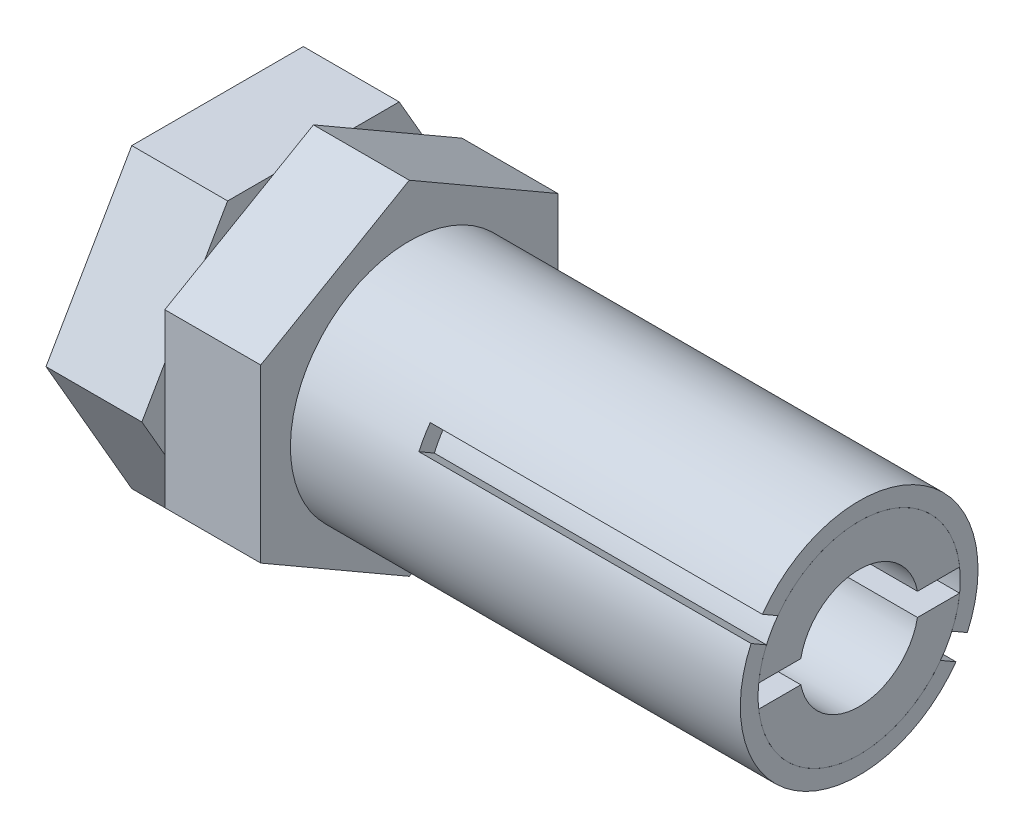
ISO-10303-21;
HEADER;
FILE_DESCRIPTION(('STEP AP214'),'2;1');
FILE_NAME('part.step','',(''),(''),'','','');
FILE_SCHEMA(('AUTOMOTIVE_DESIGN { 1 0 10303 214 1 1 1 1 }'));
ENDSEC;
DATA;
#1=APPLICATION_CONTEXT('core data for automotive mechanical design processes');
#2=APPLICATION_PROTOCOL_DEFINITION('international standard','automotive_design',2000,#1);
#3=PRODUCT_CONTEXT('',#1,'mechanical');
#4=PRODUCT('Part','Part','',(#3));
#5=PRODUCT_RELATED_PRODUCT_CATEGORY('part','',(#4));
#6=PRODUCT_DEFINITION_FORMATION('','',#4);
#7=PRODUCT_DEFINITION_CONTEXT('part definition',#1,'design');
#8=PRODUCT_DEFINITION('design','',#6,#7);
#9=PRODUCT_DEFINITION_SHAPE('','',#8);
#10=(LENGTH_UNIT() NAMED_UNIT(*) SI_UNIT(.MILLI.,.METRE.));
#11=(NAMED_UNIT(*) PLANE_ANGLE_UNIT() SI_UNIT($,.RADIAN.));
#12=(NAMED_UNIT(*) SI_UNIT($,.STERADIAN.) SOLID_ANGLE_UNIT());
#13=UNCERTAINTY_MEASURE_WITH_UNIT(LENGTH_MEASURE(1.E-05),#10,'distance_accuracy_value','');
#14=(GEOMETRIC_REPRESENTATION_CONTEXT(3) GLOBAL_UNCERTAINTY_ASSIGNED_CONTEXT((#13)) GLOBAL_UNIT_ASSIGNED_CONTEXT((#10,
#11,#12)) REPRESENTATION_CONTEXT('',''));
#15=CARTESIAN_POINT('',(0.,0.,0.));
#16=DIRECTION('',(0.,0.,1.));
#17=DIRECTION('',(1.,0.,0.));
#18=AXIS2_PLACEMENT_3D('',#15,#16,#17);
#19=CARTESIAN_POINT('',(21.59,0.,0.));
#20=DIRECTION('',(1.,0.,0.));
#21=DIRECTION('',(0.,0.,-1.));
#22=AXIS2_PLACEMENT_3D('',#19,#20,#21);
#23=PLANE('',#22);
#24=DIRECTION('',(0.,-0.499999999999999,-0.866025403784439));
#25=VECTOR('',#24,1.);
#26=CARTESIAN_POINT('',(21.59,4.27300486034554,6.63906151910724));
#27=LINE('',#26,#25);
#28=CARTESIAN_POINT('',(21.59,-1.3611483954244,-3.11957817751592));
#29=VERTEX_POINT('',#28);
#30=CARTESIAN_POINT('',(21.59,-1.66056432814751,-3.63818178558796));
#31=VERTEX_POINT('',#30);
#32=EDGE_CURVE('E273',#29,#31,#27,.T.);
#33=ORIENTED_EDGE('',*,*,#32,.T.);
#34=CARTESIAN_POINT('',(21.59,0.,0.));
#35=DIRECTION('',(1.,0.,0.));
#36=DIRECTION('',(0.,0.,-1.));
#37=AXIS2_PLACEMENT_3D('',#34,#35,#36);
#38=CIRCLE('',#37,3.99923);
#39=CARTESIAN_POINT('',(21.59,2.32047568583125,3.25718178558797));
#40=VERTEX_POINT('',#39);
#41=EDGE_CURVE('E51',#31,#40,#38,.T.);
#42=ORIENTED_EDGE('',*,*,#41,.T.);
#43=DIRECTION('',(0.,-0.499999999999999,-0.866025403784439));
#44=VECTOR('',#43,1.);
#45=CARTESIAN_POINT('',(21.59,-3.61309350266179,-7.02006151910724));
#46=LINE('',#45,#44);
#47=CARTESIAN_POINT('',(21.59,2.02105975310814,2.73857817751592));
#48=VERTEX_POINT('',#47);
#49=EDGE_CURVE('E153',#40,#48,#46,.T.);
#50=ORIENTED_EDGE('',*,*,#49,.T.);
#51=CARTESIAN_POINT('',(21.59,0.,0.));
#52=DIRECTION('',(1.,0.,0.));
#53=DIRECTION('',(0.,0.,-1.));
#54=AXIS2_PLACEMENT_3D('',#51,#52,#53);
#55=CIRCLE('',#54,3.4036);
#56=EDGE_CURVE('E128',#29,#48,#55,.T.);
#57=ORIENTED_EDGE('',*,*,#56,.F.);
#58=EDGE_LOOP('',(#33,#42,#50,#57));
#59=FACE_BOUND('',#58,.T.);
#60=ADVANCED_FACE('F42',(#59),#23,.T.);
#61=DIRECTION('',(0.,0.499999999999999,0.866025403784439));
#62=VECTOR('',#61,1.);
#63=CARTESIAN_POINT('',(21.59,3.6130935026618,7.02006151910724));
#64=LINE('',#63,#62);
#65=CARTESIAN_POINT('',(21.59,-2.32047568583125,-3.25718178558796));
#66=VERTEX_POINT('',#65);
#67=CARTESIAN_POINT('',(21.59,-2.02105975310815,-2.73857817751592));
#68=VERTEX_POINT('',#67);
#69=EDGE_CURVE('E109',#66,#68,#64,.T.);
#70=ORIENTED_EDGE('',*,*,#69,.T.);
#71=CARTESIAN_POINT('',(21.59,1.3611483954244,3.11957817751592));
#72=VERTEX_POINT('',#71);
#73=EDGE_CURVE('E119',#72,#68,#55,.T.);
#74=ORIENTED_EDGE('',*,*,#73,.F.);
#75=DIRECTION('',(0.,0.499999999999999,0.866025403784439));
#76=VECTOR('',#75,1.);
#77=CARTESIAN_POINT('',(21.59,-4.27300486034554,-6.63906151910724));
#78=LINE('',#77,#76);
#79=CARTESIAN_POINT('',(21.59,1.66056432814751,3.63818178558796));
#80=VERTEX_POINT('',#79);
#81=EDGE_CURVE('E66',#72,#80,#78,.T.);
#82=ORIENTED_EDGE('',*,*,#81,.T.);
#83=EDGE_CURVE('E12',#80,#66,#38,.T.);
#84=ORIENTED_EDGE('',*,*,#83,.T.);
#85=EDGE_LOOP('',(#70,#74,#82,#84));
#86=FACE_BOUND('',#85,.T.);
#87=ADVANCED_FACE('F118',(#86),#23,.T.);
#88=CARTESIAN_POINT('',(6.4516,0.,0.));
#89=DIRECTION('',(1.,0.,0.));
#90=DIRECTION('',(0.,0.,-1.));
#91=AXIS2_PLACEMENT_3D('',#88,#89,#90);
#92=PLANE('',#91);
#93=CARTESIAN_POINT('',(6.4516,0.,0.));
#94=DIRECTION('',(1.,0.,0.));
#95=DIRECTION('',(0.,0.,-1.));
#96=AXIS2_PLACEMENT_3D('',#93,#94,#95);
#97=CIRCLE('',#96,3.99923);
#98=CARTESIAN_POINT('',(6.4516,0.,-3.99923));
#99=VERTEX_POINT('',#98);
#100=EDGE_CURVE('E46',#99,#99,#97,.T.);
#101=ORIENTED_EDGE('',*,*,#100,.F.);
#102=EDGE_LOOP('',(#101));
#103=FACE_BOUND('',#102,.T.);
#104=CARTESIAN_POINT('',(6.4516,0.,0.));
#105=DIRECTION('',(1.,0.,0.));
#106=DIRECTION('',(0.,0.,-1.));
#107=AXIS2_PLACEMENT_3D('',#104,#105,#106);
#108=CIRCLE('',#107,3.4036);
#109=CARTESIAN_POINT('',(6.4516,0.,-3.4036));
#110=VERTEX_POINT('',#109);
#111=EDGE_CURVE('E131',#110,#110,#108,.T.);
#112=ORIENTED_EDGE('',*,*,#111,.T.);
#113=EDGE_LOOP('',(#112));
#114=FACE_BOUND('',#113,.T.);
#115=ADVANCED_FACE('F195',(#103,#114),#92,.F.);
#116=CARTESIAN_POINT('',(21.59,0.,0.));
#117=DIRECTION('',(-1.,0.,0.));
#118=DIRECTION('',(0.,0.,1.));
#119=AXIS2_PLACEMENT_3D('',#116,#117,#118);
#120=CYLINDRICAL_SURFACE('',#119,3.99923);
#121=ORIENTED_EDGE('',*,*,#41,.F.);
#122=DIRECTION('',(-1.,0.,0.));
#123=VECTOR('',#122,1.);
#124=CARTESIAN_POINT('',(21.59,-1.66056432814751,-3.63818178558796));
#125=LINE('',#124,#123);
#126=CARTESIAN_POINT('',(10.414,-1.66056432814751,-3.63818178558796));
#127=VERTEX_POINT('',#126);
#128=EDGE_CURVE('E269',#127,#31,#125,.F.);
#129=ORIENTED_EDGE('',*,*,#128,.F.);
#130=CARTESIAN_POINT('',(10.414,0.,0.));
#131=DIRECTION('',(-1.,0.,0.));
#132=DIRECTION('',(0.,0.,1.));
#133=AXIS2_PLACEMENT_3D('',#130,#131,#132);
#134=CIRCLE('',#133,3.99923);
#135=CARTESIAN_POINT('',(10.414,-2.32047568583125,-3.25718178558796));
#136=VERTEX_POINT('',#135);
#137=EDGE_CURVE('E267',#136,#127,#134,.F.);
#138=ORIENTED_EDGE('',*,*,#137,.F.);
#139=DIRECTION('',(-1.,0.,0.));
#140=VECTOR('',#139,1.);
#141=CARTESIAN_POINT('',(21.59,-2.32047568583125,-3.25718178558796));
#142=LINE('',#141,#140);
#143=EDGE_CURVE('E121',#66,#136,#142,.T.);
#144=ORIENTED_EDGE('',*,*,#143,.F.);
#145=ORIENTED_EDGE('',*,*,#83,.F.);
#146=DIRECTION('',(-1.,0.,0.));
#147=VECTOR('',#146,1.);
#148=CARTESIAN_POINT('',(21.59,1.6605643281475,3.63818178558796));
#149=LINE('',#148,#147);
#150=CARTESIAN_POINT('',(10.414,1.6605643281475,3.63818178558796));
#151=VERTEX_POINT('',#150);
#152=EDGE_CURVE('E137',#151,#80,#149,.F.);
#153=ORIENTED_EDGE('',*,*,#152,.F.);
#154=CARTESIAN_POINT('',(10.414,0.,0.));
#155=DIRECTION('',(-1.,0.,0.));
#156=DIRECTION('',(0.,0.,1.));
#157=AXIS2_PLACEMENT_3D('',#154,#155,#156);
#158=CIRCLE('',#157,3.99923);
#159=CARTESIAN_POINT('',(10.414,2.32047568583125,3.25718178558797));
#160=VERTEX_POINT('',#159);
#161=EDGE_CURVE('E140',#160,#151,#158,.F.);
#162=ORIENTED_EDGE('',*,*,#161,.F.);
#163=DIRECTION('',(-1.,0.,0.));
#164=VECTOR('',#163,1.);
#165=CARTESIAN_POINT('',(21.59,2.32047568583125,3.25718178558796));
#166=LINE('',#165,#164);
#167=EDGE_CURVE('E144',#40,#160,#166,.T.);
#168=ORIENTED_EDGE('',*,*,#167,.F.);
#169=EDGE_LOOP('',(#121,#129,#138,#144,#145,#153,#162,#168));
#170=FACE_BOUND('',#169,.T.);
#171=ORIENTED_EDGE('',*,*,#100,.T.);
#172=EDGE_LOOP('',(#171));
#173=FACE_BOUND('',#172,.T.);
#174=ADVANCED_FACE('F44',(#170,#173),#120,.T.);
#175=CARTESIAN_POINT('',(21.59,0.,0.));
#176=DIRECTION('',(-1.,0.,0.));
#177=DIRECTION('',(0.,0.,1.));
#178=AXIS2_PLACEMENT_3D('',#175,#176,#177);
#179=CYLINDRICAL_SURFACE('',#178,3.4036);
#180=DIRECTION('',(-1.,0.,0.));
#181=VECTOR('',#180,1.);
#182=CARTESIAN_POINT('',(21.59,-1.3611483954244,-3.11957817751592));
#183=LINE('',#182,#181);
#184=CARTESIAN_POINT('',(10.414,-1.3611483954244,-3.11957817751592));
#185=VERTEX_POINT('',#184);
#186=EDGE_CURVE('E270',#185,#29,#183,.F.);
#187=ORIENTED_EDGE('',*,*,#186,.T.);
#188=ORIENTED_EDGE('',*,*,#56,.T.);
#189=DIRECTION('',(-1.,0.,0.));
#190=VECTOR('',#189,1.);
#191=CARTESIAN_POINT('',(21.59,2.02105975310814,2.73857817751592));
#192=LINE('',#191,#190);
#193=CARTESIAN_POINT('',(10.414,2.02105975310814,2.73857817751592));
#194=VERTEX_POINT('',#193);
#195=EDGE_CURVE('E150',#48,#194,#192,.T.);
#196=ORIENTED_EDGE('',*,*,#195,.T.);
#197=CARTESIAN_POINT('',(10.414,0.,0.));
#198=DIRECTION('',(-1.,0.,0.));
#199=DIRECTION('',(0.,0.,1.));
#200=AXIS2_PLACEMENT_3D('',#197,#198,#199);
#201=CIRCLE('',#200,3.4036);
#202=CARTESIAN_POINT('',(10.414,1.3611483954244,3.11957817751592));
#203=VERTEX_POINT('',#202);
#204=EDGE_CURVE('E134',#194,#203,#201,.F.);
#205=ORIENTED_EDGE('',*,*,#204,.T.);
#206=DIRECTION('',(-1.,0.,0.));
#207=VECTOR('',#206,1.);
#208=CARTESIAN_POINT('',(21.59,1.3611483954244,3.11957817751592));
#209=LINE('',#208,#207);
#210=EDGE_CURVE('E127',#203,#72,#209,.F.);
#211=ORIENTED_EDGE('',*,*,#210,.T.);
#212=ORIENTED_EDGE('',*,*,#73,.T.);
#213=DIRECTION('',(-1.,0.,0.));
#214=VECTOR('',#213,1.);
#215=CARTESIAN_POINT('',(21.59,-2.02105975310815,-2.73857817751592));
#216=LINE('',#215,#214);
#217=CARTESIAN_POINT('',(10.414,-2.02105975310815,-2.73857817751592));
#218=VERTEX_POINT('',#217);
#219=EDGE_CURVE('E106',#68,#218,#216,.T.);
#220=ORIENTED_EDGE('',*,*,#219,.T.);
#221=CARTESIAN_POINT('',(10.414,0.,0.));
#222=DIRECTION('',(-1.,0.,0.));
#223=DIRECTION('',(0.,0.,1.));
#224=AXIS2_PLACEMENT_3D('',#221,#222,#223);
#225=CIRCLE('',#224,3.4036);
#226=EDGE_CURVE('E279',#218,#185,#225,.F.);
#227=ORIENTED_EDGE('',*,*,#226,.T.);
#228=EDGE_LOOP('',(#187,#188,#196,#205,#211,#212,#220,#227));
#229=FACE_BOUND('',#228,.T.);
#230=ORIENTED_EDGE('',*,*,#111,.F.);
#231=EDGE_LOOP('',(#230));
#232=FACE_BOUND('',#231,.T.);
#233=ADVANCED_FACE('F124',(#229,#232),#179,.F.);
#234=CARTESIAN_POINT('',(10.414,-3.61309350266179,-7.02006151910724));
#235=DIRECTION('',(-1.,0.,0.));
#236=DIRECTION('',(0.,0.,1.));
#237=AXIS2_PLACEMENT_3D('',#234,#235,#236);
#238=PLANE('',#237);
#239=ORIENTED_EDGE('',*,*,#161,.T.);
#240=DIRECTION('',(0.,0.499999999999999,0.866025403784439));
#241=VECTOR('',#240,1.);
#242=CARTESIAN_POINT('',(10.414,-4.27300486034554,-6.63906151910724));
#243=LINE('',#242,#241);
#244=EDGE_CURVE('E157',#203,#151,#243,.T.);
#245=ORIENTED_EDGE('',*,*,#244,.F.);
#246=ORIENTED_EDGE('',*,*,#204,.F.);
#247=DIRECTION('',(0.,0.499999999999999,0.866025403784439));
#248=VECTOR('',#247,1.);
#249=CARTESIAN_POINT('',(10.414,-3.61309350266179,-7.02006151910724));
#250=LINE('',#249,#248);
#251=EDGE_CURVE('E148',#194,#160,#250,.T.);
#252=ORIENTED_EDGE('',*,*,#251,.T.);
#253=EDGE_LOOP('',(#239,#245,#246,#252));
#254=FACE_BOUND('',#253,.T.);
#255=ADVANCED_FACE('F176',(#254),#238,.F.);
#256=CARTESIAN_POINT('',(10.414,-3.61309350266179,-7.02006151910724));
#257=DIRECTION('',(0.,0.866025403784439,-0.499999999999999));
#258=DIRECTION('',(0.,0.499999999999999,0.866025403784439));
#259=AXIS2_PLACEMENT_3D('',#256,#257,#258);
#260=PLANE('',#259);
#261=ORIENTED_EDGE('',*,*,#167,.T.);
#262=ORIENTED_EDGE('',*,*,#251,.F.);
#263=ORIENTED_EDGE('',*,*,#195,.F.);
#264=ORIENTED_EDGE('',*,*,#49,.F.);
#265=EDGE_LOOP('',(#261,#262,#263,#264));
#266=FACE_BOUND('',#265,.T.);
#267=ADVANCED_FACE('F168',(#266),#260,.F.);
#268=CARTESIAN_POINT('',(10.414,-4.27300486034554,-6.63906151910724));
#269=DIRECTION('',(0.,-0.866025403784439,0.499999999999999));
#270=DIRECTION('',(0.,-0.499999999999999,-0.866025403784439));
#271=AXIS2_PLACEMENT_3D('',#268,#269,#270);
#272=PLANE('',#271);
#273=ORIENTED_EDGE('',*,*,#152,.T.);
#274=ORIENTED_EDGE('',*,*,#81,.F.);
#275=ORIENTED_EDGE('',*,*,#210,.F.);
#276=ORIENTED_EDGE('',*,*,#244,.T.);
#277=EDGE_LOOP('',(#273,#274,#275,#276));
#278=FACE_BOUND('',#277,.T.);
#279=ADVANCED_FACE('F177',(#278),#272,.F.);
#280=CARTESIAN_POINT('',(22.0859277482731,4.27300486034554,6.63906151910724));
#281=DIRECTION('',(0.,0.866025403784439,-0.499999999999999));
#282=DIRECTION('',(0.,0.499999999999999,0.866025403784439));
#283=AXIS2_PLACEMENT_3D('',#280,#281,#282);
#284=PLANE('',#283);
#285=ORIENTED_EDGE('',*,*,#128,.T.);
#286=ORIENTED_EDGE('',*,*,#32,.F.);
#287=ORIENTED_EDGE('',*,*,#186,.F.);
#288=DIRECTION('',(0.,-0.499999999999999,-0.866025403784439));
#289=VECTOR('',#288,1.);
#290=CARTESIAN_POINT('',(10.414,4.27300486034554,6.63906151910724));
#291=LINE('',#290,#289);
#292=EDGE_CURVE('E114',#185,#127,#291,.T.);
#293=ORIENTED_EDGE('',*,*,#292,.T.);
#294=EDGE_LOOP('',(#285,#286,#287,#293));
#295=FACE_BOUND('',#294,.T.);
#296=ADVANCED_FACE('F179',(#295),#284,.F.);
#297=CARTESIAN_POINT('',(10.414,4.27300486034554,6.63906151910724));
#298=DIRECTION('',(-1.,0.,0.));
#299=DIRECTION('',(0.,0.,1.));
#300=AXIS2_PLACEMENT_3D('',#297,#298,#299);
#301=PLANE('',#300);
#302=ORIENTED_EDGE('',*,*,#137,.T.);
#303=ORIENTED_EDGE('',*,*,#292,.F.);
#304=ORIENTED_EDGE('',*,*,#226,.F.);
#305=DIRECTION('',(0.,-0.499999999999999,-0.866025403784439));
#306=VECTOR('',#305,1.);
#307=CARTESIAN_POINT('',(10.414,3.6130935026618,7.02006151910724));
#308=LINE('',#307,#306);
#309=EDGE_CURVE('E58',#218,#136,#308,.T.);
#310=ORIENTED_EDGE('',*,*,#309,.T.);
#311=EDGE_LOOP('',(#302,#303,#304,#310));
#312=FACE_BOUND('',#311,.T.);
#313=ADVANCED_FACE('F185',(#312),#301,.F.);
#314=CARTESIAN_POINT('',(22.0859277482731,3.6130935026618,7.02006151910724));
#315=DIRECTION('',(0.,-0.866025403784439,0.499999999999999));
#316=DIRECTION('',(0.,-0.499999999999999,-0.866025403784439));
#317=AXIS2_PLACEMENT_3D('',#314,#315,#316);
#318=PLANE('',#317);
#319=ORIENTED_EDGE('',*,*,#143,.T.);
#320=ORIENTED_EDGE('',*,*,#309,.F.);
#321=ORIENTED_EDGE('',*,*,#219,.F.);
#322=ORIENTED_EDGE('',*,*,#69,.F.);
#323=EDGE_LOOP('',(#319,#320,#321,#322));
#324=FACE_BOUND('',#323,.T.);
#325=ADVANCED_FACE('F108',(#324),#318,.F.);
#326=CLOSED_SHELL('',(#60,#87,#115,#174,#233,#255,#267,#279,#296,#313,#325));
#327=MANIFOLD_SOLID_BREP('B2',#326);
#328=CARTESIAN_POINT('',(21.59,0.,0.));
#329=DIRECTION('',(1.,0.,0.));
#330=DIRECTION('',(0.,0.,-1.));
#331=AXIS2_PLACEMENT_3D('',#328,#329,#330);
#332=PLANE('',#331);
#333=DIRECTION('',(0.,0.,1.));
#334=VECTOR('',#333,1.);
#335=CARTESIAN_POINT('',(21.59,0.380999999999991,0.));
#336=LINE('',#335,#334);
#337=CARTESIAN_POINT('',(21.59,0.380999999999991,-3.38220814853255));
#338=VERTEX_POINT('',#337);
#339=CARTESIAN_POINT('',(21.59,0.380999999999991,-1.96233535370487));
#340=VERTEX_POINT('',#339);
#341=EDGE_CURVE('E525',#338,#340,#336,.T.);
#342=ORIENTED_EDGE('',*,*,#341,.F.);
#343=CARTESIAN_POINT('',(21.59,0.,0.));
#344=DIRECTION('',(1.,0.,0.));
#345=DIRECTION('',(0.,0.,-1.));
#346=AXIS2_PLACEMENT_3D('',#343,#344,#345);
#347=CIRCLE('',#346,3.4036);
#348=CARTESIAN_POINT('',(21.59,0.380999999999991,3.38220814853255));
#349=VERTEX_POINT('',#348);
#350=EDGE_CURVE('E533',#338,#349,#347,.T.);
#351=ORIENTED_EDGE('',*,*,#350,.T.);
#352=CARTESIAN_POINT('',(21.59,0.380999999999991,1.96233535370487));
#353=VERTEX_POINT('',#352);
#354=EDGE_CURVE('E501',#353,#349,#336,.T.);
#355=ORIENTED_EDGE('',*,*,#354,.F.);
#356=CARTESIAN_POINT('',(21.59,0.,0.));
#357=DIRECTION('',(1.,0.,0.));
#358=DIRECTION('',(0.,0.,-1.));
#359=AXIS2_PLACEMENT_3D('',#356,#357,#358);
#360=CIRCLE('',#359,1.99898);
#361=EDGE_CURVE('E524',#340,#353,#360,.T.);
#362=ORIENTED_EDGE('',*,*,#361,.F.);
#363=EDGE_LOOP('',(#342,#351,#355,#362));
#364=FACE_BOUND('',#363,.T.);
#365=ADVANCED_FACE('F287',(#364),#332,.T.);
#366=CARTESIAN_POINT('',(6.4516,-8.65803701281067,-4.99872));
#367=DIRECTION('',(-1.,0.,0.));
#368=DIRECTION('',(0.,0.,1.));
#369=AXIS2_PLACEMENT_3D('',#366,#367,#368);
#370=PLANE('',#369);
#371=DIRECTION('',(0.,1.,0.));
#372=VECTOR('',#371,1.);
#373=CARTESIAN_POINT('',(6.4516,-2.88601233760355,-4.99871999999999));
#374=LINE('',#373,#372);
#375=CARTESIAN_POINT('',(6.4516,-2.88601233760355,-4.99871999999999));
#376=VERTEX_POINT('',#375);
#377=CARTESIAN_POINT('',(6.4516,2.88601233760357,-4.99871999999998));
#378=VERTEX_POINT('',#377);
#379=EDGE_CURVE('E536',#376,#378,#374,.T.);
#380=ORIENTED_EDGE('',*,*,#379,.T.);
#381=DIRECTION('',(0.,0.499999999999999,0.866025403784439));
#382=VECTOR('',#381,1.);
#383=CARTESIAN_POINT('',(6.4516,2.88601233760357,-4.99871999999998));
#384=LINE('',#383,#382);
#385=CARTESIAN_POINT('',(6.4516,5.77202467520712,0.));
#386=VERTEX_POINT('',#385);
#387=EDGE_CURVE('E539',#378,#386,#384,.T.);
#388=ORIENTED_EDGE('',*,*,#387,.T.);
#389=DIRECTION('',(0.,-0.500000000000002,0.866025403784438));
#390=VECTOR('',#389,1.);
#391=CARTESIAN_POINT('',(6.4516,5.77202467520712,0.));
#392=LINE('',#391,#390);
#393=CARTESIAN_POINT('',(6.4516,2.88601233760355,4.99871999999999));
#394=VERTEX_POINT('',#393);
#395=EDGE_CURVE('E542',#386,#394,#392,.T.);
#396=ORIENTED_EDGE('',*,*,#395,.T.);
#397=DIRECTION('',(0.,-1.,0.));
#398=VECTOR('',#397,1.);
#399=CARTESIAN_POINT('',(6.4516,2.88601233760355,4.99871999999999));
#400=LINE('',#399,#398);
#401=CARTESIAN_POINT('',(6.4516,-2.88601233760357,4.99871999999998));
#402=VERTEX_POINT('',#401);
#403=EDGE_CURVE('E544',#394,#402,#400,.T.);
#404=ORIENTED_EDGE('',*,*,#403,.T.);
#405=DIRECTION('',(0.,-0.499999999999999,-0.866025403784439));
#406=VECTOR('',#405,1.);
#407=CARTESIAN_POINT('',(6.4516,-2.88601233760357,4.99871999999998));
#408=LINE('',#407,#406);
#409=CARTESIAN_POINT('',(6.4516,-5.77202467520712,0.));
#410=VERTEX_POINT('',#409);
#411=EDGE_CURVE('E546',#402,#410,#408,.T.);
#412=ORIENTED_EDGE('',*,*,#411,.T.);
#413=DIRECTION('',(0.,0.500000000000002,-0.866025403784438));
#414=VECTOR('',#413,1.);
#415=CARTESIAN_POINT('',(6.4516,-5.77202467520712,0.));
#416=LINE('',#415,#414);
#417=EDGE_CURVE('E548',#410,#376,#416,.T.);
#418=ORIENTED_EDGE('',*,*,#417,.T.);
#419=EDGE_LOOP('',(#380,#388,#396,#404,#412,#418));
#420=FACE_BOUND('',#419,.T.);
#421=CARTESIAN_POINT('',(6.4516,0.,0.));
#422=DIRECTION('',(-1.,0.,0.));
#423=DIRECTION('',(0.,0.,1.));
#424=AXIS2_PLACEMENT_3D('',#421,#422,#423);
#425=CIRCLE('',#424,3.4036);
#426=CARTESIAN_POINT('',(6.4516,0.,3.4036));
#427=VERTEX_POINT('',#426);
#428=EDGE_CURVE('E471',#427,#427,#425,.F.);
#429=ORIENTED_EDGE('',*,*,#428,.F.);
#430=EDGE_LOOP('',(#429));
#431=FACE_BOUND('',#430,.T.);
#432=ADVANCED_FACE('F678',(#420,#431),#370,.F.);
#433=CARTESIAN_POINT('',(3.2258,-4.99872000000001,-2.88601233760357));
#434=DIRECTION('',(-1.,0.,0.));
#435=DIRECTION('',(0.,0.,1.));
#436=AXIS2_PLACEMENT_3D('',#433,#434,#435);
#437=PLANE('',#436);
#438=DIRECTION('',(0.,1.,0.));
#439=VECTOR('',#438,1.);
#440=CARTESIAN_POINT('',(3.2258,-2.88601233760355,-4.99871999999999));
#441=LINE('',#440,#439);
#442=CARTESIAN_POINT('',(3.2258,-1.33940298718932,-4.99871999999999));
#443=VERTEX_POINT('',#442);
#444=CARTESIAN_POINT('',(3.2258,1.33940298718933,-4.99871999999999));
#445=VERTEX_POINT('',#444);
#446=EDGE_CURVE('E555',#443,#445,#441,.T.);
#447=ORIENTED_EDGE('',*,*,#446,.F.);
#448=DIRECTION('',(0.,0.866025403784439,-0.499999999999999));
#449=VECTOR('',#448,1.);
#450=CARTESIAN_POINT('',(3.2258,-4.99872000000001,-2.88601233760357));
#451=LINE('',#450,#449);
#452=CARTESIAN_POINT('',(3.2258,0.,-5.77202467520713));
#453=VERTEX_POINT('',#452);
#454=EDGE_CURVE('E605',#443,#453,#451,.T.);
#455=ORIENTED_EDGE('',*,*,#454,.T.);
#456=DIRECTION('',(0.,0.866025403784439,0.5));
#457=VECTOR('',#456,1.);
#458=CARTESIAN_POINT('',(3.2258,0.,-5.77202467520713));
#459=LINE('',#458,#457);
#460=EDGE_CURVE('E606',#453,#445,#459,.T.);
#461=ORIENTED_EDGE('',*,*,#460,.T.);
#462=EDGE_LOOP('',(#447,#455,#461));
#463=FACE_BOUND('',#462,.T.);
#464=ADVANCED_FACE('F693',(#463),#437,.F.);
#465=DIRECTION('',(0.,0.500000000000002,-0.866025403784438));
#466=VECTOR('',#465,1.);
#467=CARTESIAN_POINT('',(3.2258,-5.77202467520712,0.));
#468=LINE('',#467,#466);
#469=CARTESIAN_POINT('',(3.2258,-4.99872000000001,-1.33940298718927));
#470=VERTEX_POINT('',#469);
#471=CARTESIAN_POINT('',(3.2258,-3.65931701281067,-3.65931701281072));
#472=VERTEX_POINT('',#471);
#473=EDGE_CURVE('E578',#470,#472,#468,.T.);
#474=ORIENTED_EDGE('',*,*,#473,.F.);
#475=DIRECTION('',(0.,0.,-1.));
#476=VECTOR('',#475,1.);
#477=CARTESIAN_POINT('',(3.2258,-4.99872000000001,2.88601233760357));
#478=LINE('',#477,#476);
#479=CARTESIAN_POINT('',(3.2258,-4.99872000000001,-2.88601233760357));
#480=VERTEX_POINT('',#479);
#481=EDGE_CURVE('E623',#470,#480,#478,.T.);
#482=ORIENTED_EDGE('',*,*,#481,.T.);
#483=EDGE_CURVE('E600',#480,#472,#451,.T.);
#484=ORIENTED_EDGE('',*,*,#483,.T.);
#485=EDGE_LOOP('',(#474,#482,#484));
#486=FACE_BOUND('',#485,.T.);
#487=ADVANCED_FACE('F760',(#486),#437,.F.);
#488=DIRECTION('',(0.,-0.499999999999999,-0.866025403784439));
#489=VECTOR('',#488,1.);
#490=CARTESIAN_POINT('',(3.2258,-2.88601233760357,4.99871999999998));
#491=LINE('',#490,#489);
#492=CARTESIAN_POINT('',(3.2258,-3.65931701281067,3.65931701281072));
#493=VERTEX_POINT('',#492);
#494=CARTESIAN_POINT('',(3.2258,-4.99872000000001,1.33940298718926));
#495=VERTEX_POINT('',#494);
#496=EDGE_CURVE('E575',#493,#495,#491,.T.);
#497=ORIENTED_EDGE('',*,*,#496,.F.);
#498=DIRECTION('',(0.,-0.866025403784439,-0.5));
#499=VECTOR('',#498,1.);
#500=CARTESIAN_POINT('',(3.2258,0.,5.77202467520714));
#501=LINE('',#500,#499);
#502=CARTESIAN_POINT('',(3.2258,-4.99872000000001,2.88601233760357));
#503=VERTEX_POINT('',#502);
#504=EDGE_CURVE('E618',#493,#503,#501,.T.);
#505=ORIENTED_EDGE('',*,*,#504,.T.);
#506=EDGE_CURVE('E625',#503,#495,#478,.T.);
#507=ORIENTED_EDGE('',*,*,#506,.T.);
#508=EDGE_LOOP('',(#497,#505,#507));
#509=FACE_BOUND('',#508,.T.);
#510=ADVANCED_FACE('F749',(#509),#437,.F.);
#511=DIRECTION('',(0.,-1.,0.));
#512=VECTOR('',#511,1.);
#513=CARTESIAN_POINT('',(3.2258,2.88601233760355,4.99871999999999));
#514=LINE('',#513,#512);
#515=CARTESIAN_POINT('',(3.2258,1.33940298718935,4.99871999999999));
#516=VERTEX_POINT('',#515);
#517=CARTESIAN_POINT('',(3.2258,-1.33940298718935,4.99871999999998));
#518=VERTEX_POINT('',#517);
#519=EDGE_CURVE('E570',#516,#518,#514,.T.);
#520=ORIENTED_EDGE('',*,*,#519,.F.);
#521=DIRECTION('',(0.,-0.866025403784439,0.499999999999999));
#522=VECTOR('',#521,1.);
#523=CARTESIAN_POINT('',(3.2258,4.99872000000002,2.88601233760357));
#524=LINE('',#523,#522);
#525=CARTESIAN_POINT('',(3.2258,0.,5.77202467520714));
#526=VERTEX_POINT('',#525);
#527=EDGE_CURVE('E613',#516,#526,#524,.T.);
#528=ORIENTED_EDGE('',*,*,#527,.T.);
#529=EDGE_CURVE('E620',#526,#518,#501,.T.);
#530=ORIENTED_EDGE('',*,*,#529,.T.);
#531=EDGE_LOOP('',(#520,#528,#530));
#532=FACE_BOUND('',#531,.T.);
#533=ADVANCED_FACE('F737',(#532),#437,.F.);
#534=DIRECTION('',(0.,-0.500000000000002,0.866025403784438));
#535=VECTOR('',#534,1.);
#536=CARTESIAN_POINT('',(3.2258,5.77202467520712,0.));
#537=LINE('',#536,#535);
#538=CARTESIAN_POINT('',(3.2258,4.99872000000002,1.33940298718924));
#539=VERTEX_POINT('',#538);
#540=CARTESIAN_POINT('',(3.2258,3.65931701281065,3.65931701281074));
#541=VERTEX_POINT('',#540);
#542=EDGE_CURVE('E565',#539,#541,#537,.T.);
#543=ORIENTED_EDGE('',*,*,#542,.F.);
#544=DIRECTION('',(0.,0.,1.));
#545=VECTOR('',#544,1.);
#546=CARTESIAN_POINT('',(3.2258,4.99872000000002,-2.88601233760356));
#547=LINE('',#546,#545);
#548=CARTESIAN_POINT('',(3.2258,4.99872000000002,2.88601233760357));
#549=VERTEX_POINT('',#548);
#550=EDGE_CURVE('E609',#539,#549,#547,.T.);
#551=ORIENTED_EDGE('',*,*,#550,.T.);
#552=EDGE_CURVE('E615',#549,#541,#524,.T.);
#553=ORIENTED_EDGE('',*,*,#552,.T.);
#554=EDGE_LOOP('',(#543,#551,#553));
#555=FACE_BOUND('',#554,.T.);
#556=ADVANCED_FACE('F726',(#555),#437,.F.);
#557=DIRECTION('',(0.,0.499999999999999,0.866025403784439));
#558=VECTOR('',#557,1.);
#559=CARTESIAN_POINT('',(3.2258,2.88601233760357,-4.99871999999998));
#560=LINE('',#559,#558);
#561=CARTESIAN_POINT('',(3.2258,3.65931701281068,-3.65931701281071));
#562=VERTEX_POINT('',#561);
#563=CARTESIAN_POINT('',(3.2258,4.99872000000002,-1.33940298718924));
#564=VERTEX_POINT('',#563);
#565=EDGE_CURVE('E560',#562,#564,#560,.T.);
#566=ORIENTED_EDGE('',*,*,#565,.F.);
#567=CARTESIAN_POINT('',(3.2258,4.99872000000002,-2.88601233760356));
#568=VERTEX_POINT('',#567);
#569=EDGE_CURVE('E603',#562,#568,#459,.T.);
#570=ORIENTED_EDGE('',*,*,#569,.T.);
#571=EDGE_CURVE('E611',#568,#564,#547,.T.);
#572=ORIENTED_EDGE('',*,*,#571,.T.);
#573=EDGE_LOOP('',(#566,#570,#572));
#574=FACE_BOUND('',#573,.T.);
#575=ADVANCED_FACE('F717',(#574),#437,.F.);
#576=CARTESIAN_POINT('',(0.,-4.99872000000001,-2.88601233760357));
#577=DIRECTION('',(-1.,0.,0.));
#578=DIRECTION('',(0.,0.,1.));
#579=AXIS2_PLACEMENT_3D('',#576,#577,#578);
#580=PLANE('',#579);
#581=DIRECTION('',(0.,0.866025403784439,-0.499999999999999));
#582=VECTOR('',#581,1.);
#583=CARTESIAN_POINT('',(0.,-4.99872000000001,-2.88601233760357));
#584=LINE('',#583,#582);
#585=CARTESIAN_POINT('',(0.,-4.99872000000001,-2.88601233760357));
#586=VERTEX_POINT('',#585);
#587=CARTESIAN_POINT('',(0.,0.,-5.77202467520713));
#588=VERTEX_POINT('',#587);
#589=EDGE_CURVE('E599',#586,#588,#584,.T.);
#590=ORIENTED_EDGE('',*,*,#589,.F.);
#591=DIRECTION('',(0.,0.,-1.));
#592=VECTOR('',#591,1.);
#593=CARTESIAN_POINT('',(0.,-4.99872000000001,2.88601233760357));
#594=LINE('',#593,#592);
#595=CARTESIAN_POINT('',(0.,-4.99872000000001,2.88601233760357));
#596=VERTEX_POINT('',#595);
#597=EDGE_CURVE('E640',#596,#586,#594,.T.);
#598=ORIENTED_EDGE('',*,*,#597,.F.);
#599=DIRECTION('',(0.,-0.866025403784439,-0.5));
#600=VECTOR('',#599,1.);
#601=CARTESIAN_POINT('',(0.,0.,5.77202467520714));
#602=LINE('',#601,#600);
#603=CARTESIAN_POINT('',(0.,0.,5.77202467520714));
#604=VERTEX_POINT('',#603);
#605=EDGE_CURVE('E638',#604,#596,#602,.T.);
#606=ORIENTED_EDGE('',*,*,#605,.F.);
#607=DIRECTION('',(0.,-0.866025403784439,0.499999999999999));
#608=VECTOR('',#607,1.);
#609=CARTESIAN_POINT('',(0.,4.99872000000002,2.88601233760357));
#610=LINE('',#609,#608);
#611=CARTESIAN_POINT('',(0.,4.99872000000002,2.88601233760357));
#612=VERTEX_POINT('',#611);
#613=EDGE_CURVE('E636',#612,#604,#610,.T.);
#614=ORIENTED_EDGE('',*,*,#613,.F.);
#615=DIRECTION('',(0.,0.,1.));
#616=VECTOR('',#615,1.);
#617=CARTESIAN_POINT('',(0.,4.99872000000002,-2.88601233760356));
#618=LINE('',#617,#616);
#619=CARTESIAN_POINT('',(0.,4.99872000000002,-2.88601233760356));
#620=VERTEX_POINT('',#619);
#621=EDGE_CURVE('E634',#620,#612,#618,.T.);
#622=ORIENTED_EDGE('',*,*,#621,.F.);
#623=DIRECTION('',(0.,0.866025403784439,0.5));
#624=VECTOR('',#623,1.);
#625=CARTESIAN_POINT('',(0.,0.,-5.77202467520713));
#626=LINE('',#625,#624);
#627=EDGE_CURVE('E632',#588,#620,#626,.T.);
#628=ORIENTED_EDGE('',*,*,#627,.F.);
#629=EDGE_LOOP('',(#590,#598,#606,#614,#622,#628));
#630=FACE_BOUND('',#629,.T.);
#631=CARTESIAN_POINT('',(0.,0.,0.));
#632=DIRECTION('',(1.,0.,0.));
#633=DIRECTION('',(0.,0.,-1.));
#634=AXIS2_PLACEMENT_3D('',#631,#632,#633);
#635=CIRCLE('',#634,1.99898);
#636=CARTESIAN_POINT('',(0.,0.,-1.99898));
#637=VERTEX_POINT('',#636);
#638=EDGE_CURVE('E596',#637,#637,#635,.T.);
#639=ORIENTED_EDGE('',*,*,#638,.T.);
#640=EDGE_LOOP('',(#639));
#641=FACE_BOUND('',#640,.T.);
#642=ADVANCED_FACE('F702',(#630,#641),#580,.T.);
#643=CARTESIAN_POINT('',(3.2258,-4.99872000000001,-2.88601233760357));
#644=DIRECTION('',(0.,0.499999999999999,0.866025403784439));
#645=DIRECTION('',(0.,-0.866025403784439,0.5));
#646=AXIS2_PLACEMENT_3D('',#643,#644,#645);
#647=PLANE('',#646);
#648=ORIENTED_EDGE('',*,*,#589,.T.);
#649=DIRECTION('',(-1.,0.,0.));
#650=VECTOR('',#649,1.);
#651=CARTESIAN_POINT('',(3.2258,0.,-5.77202467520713));
#652=LINE('',#651,#650);
#653=EDGE_CURVE('E656',#453,#588,#652,.T.);
#654=ORIENTED_EDGE('',*,*,#653,.F.);
#655=ORIENTED_EDGE('',*,*,#454,.F.);
#656=EDGE_CURVE('E604',#472,#443,#451,.T.);
#657=ORIENTED_EDGE('',*,*,#656,.F.);
#658=ORIENTED_EDGE('',*,*,#483,.F.);
#659=DIRECTION('',(-1.,0.,0.));
#660=VECTOR('',#659,1.);
#661=CARTESIAN_POINT('',(3.2258,-4.99872000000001,-2.88601233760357));
#662=LINE('',#661,#660);
#663=EDGE_CURVE('E628',#480,#586,#662,.T.);
#664=ORIENTED_EDGE('',*,*,#663,.T.);
#665=EDGE_LOOP('',(#648,#654,#655,#657,#658,#664));
#666=FACE_BOUND('',#665,.T.);
#667=ADVANCED_FACE('F289',(#666),#647,.F.);
#668=CARTESIAN_POINT('',(3.2258,0.,-5.77202467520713));
#669=DIRECTION('',(0.,-0.5,0.866025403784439));
#670=DIRECTION('',(0.,-0.866025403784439,-0.5));
#671=AXIS2_PLACEMENT_3D('',#668,#669,#670);
#672=PLANE('',#671);
#673=ORIENTED_EDGE('',*,*,#627,.T.);
#674=DIRECTION('',(-1.,0.,0.));
#675=VECTOR('',#674,1.);
#676=CARTESIAN_POINT('',(3.2258,4.99872000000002,-2.88601233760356));
#677=LINE('',#676,#675);
#678=EDGE_CURVE('E653',#568,#620,#677,.T.);
#679=ORIENTED_EDGE('',*,*,#678,.F.);
#680=ORIENTED_EDGE('',*,*,#569,.F.);
#681=EDGE_CURVE('E610',#445,#562,#459,.T.);
#682=ORIENTED_EDGE('',*,*,#681,.F.);
#683=ORIENTED_EDGE('',*,*,#460,.F.);
#684=ORIENTED_EDGE('',*,*,#653,.T.);
#685=EDGE_LOOP('',(#673,#679,#680,#682,#683,#684));
#686=FACE_BOUND('',#685,.T.);
#687=ADVANCED_FACE('F696',(#686),#672,.F.);
#688=CARTESIAN_POINT('',(3.2258,4.99872000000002,-2.88601233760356));
#689=DIRECTION('',(0.,-1.,0.));
#690=DIRECTION('',(0.,0.,-1.));
#691=AXIS2_PLACEMENT_3D('',#688,#689,#690);
#692=PLANE('',#691);
#693=ORIENTED_EDGE('',*,*,#621,.T.);
#694=DIRECTION('',(-1.,0.,0.));
#695=VECTOR('',#694,1.);
#696=CARTESIAN_POINT('',(3.2258,4.99872000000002,2.88601233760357));
#697=LINE('',#696,#695);
#698=EDGE_CURVE('E650',#549,#612,#697,.T.);
#699=ORIENTED_EDGE('',*,*,#698,.F.);
#700=ORIENTED_EDGE('',*,*,#550,.F.);
#701=EDGE_CURVE('E614',#564,#539,#547,.T.);
#702=ORIENTED_EDGE('',*,*,#701,.F.);
#703=ORIENTED_EDGE('',*,*,#571,.F.);
#704=ORIENTED_EDGE('',*,*,#678,.T.);
#705=EDGE_LOOP('',(#693,#699,#700,#702,#703,#704));
#706=FACE_BOUND('',#705,.T.);
#707=ADVANCED_FACE('F710',(#706),#692,.F.);
#708=CARTESIAN_POINT('',(3.2258,4.99872000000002,2.88601233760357));
#709=DIRECTION('',(0.,-0.499999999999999,-0.866025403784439));
#710=DIRECTION('',(0.,0.866025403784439,-0.499999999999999));
#711=AXIS2_PLACEMENT_3D('',#708,#709,#710);
#712=PLANE('',#711);
#713=ORIENTED_EDGE('',*,*,#613,.T.);
#714=DIRECTION('',(-1.,0.,0.));
#715=VECTOR('',#714,1.);
#716=CARTESIAN_POINT('',(3.2258,0.,5.77202467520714));
#717=LINE('',#716,#715);
#718=EDGE_CURVE('E647',#526,#604,#717,.T.);
#719=ORIENTED_EDGE('',*,*,#718,.F.);
#720=ORIENTED_EDGE('',*,*,#527,.F.);
#721=EDGE_CURVE('E619',#541,#516,#524,.T.);
#722=ORIENTED_EDGE('',*,*,#721,.F.);
#723=ORIENTED_EDGE('',*,*,#552,.F.);
#724=ORIENTED_EDGE('',*,*,#698,.T.);
#725=EDGE_LOOP('',(#713,#719,#720,#722,#723,#724));
#726=FACE_BOUND('',#725,.T.);
#727=ADVANCED_FACE('F730',(#726),#712,.F.);
#728=CARTESIAN_POINT('',(3.2258,0.,5.77202467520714));
#729=DIRECTION('',(0.,0.5,-0.866025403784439));
#730=DIRECTION('',(0.,0.866025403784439,0.5));
#731=AXIS2_PLACEMENT_3D('',#728,#729,#730);
#732=PLANE('',#731);
#733=ORIENTED_EDGE('',*,*,#605,.T.);
#734=DIRECTION('',(-1.,0.,0.));
#735=VECTOR('',#734,1.);
#736=CARTESIAN_POINT('',(3.2258,-4.99872000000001,2.88601233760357));
#737=LINE('',#736,#735);
#738=EDGE_CURVE('E644',#503,#596,#737,.T.);
#739=ORIENTED_EDGE('',*,*,#738,.F.);
#740=ORIENTED_EDGE('',*,*,#504,.F.);
#741=EDGE_CURVE('E624',#518,#493,#501,.T.);
#742=ORIENTED_EDGE('',*,*,#741,.F.);
#743=ORIENTED_EDGE('',*,*,#529,.F.);
#744=ORIENTED_EDGE('',*,*,#718,.T.);
#745=EDGE_LOOP('',(#733,#739,#740,#742,#743,#744));
#746=FACE_BOUND('',#745,.T.);
#747=ADVANCED_FACE('F742',(#746),#732,.F.);
#748=CARTESIAN_POINT('',(3.2258,-4.99872000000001,2.88601233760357));
#749=DIRECTION('',(0.,1.,0.));
#750=DIRECTION('',(0.,0.,1.));
#751=AXIS2_PLACEMENT_3D('',#748,#749,#750);
#752=PLANE('',#751);
#753=ORIENTED_EDGE('',*,*,#597,.T.);
#754=ORIENTED_EDGE('',*,*,#663,.F.);
#755=ORIENTED_EDGE('',*,*,#481,.F.);
#756=EDGE_CURVE('E629',#495,#470,#478,.T.);
#757=ORIENTED_EDGE('',*,*,#756,.F.);
#758=ORIENTED_EDGE('',*,*,#506,.F.);
#759=ORIENTED_EDGE('',*,*,#738,.T.);
#760=EDGE_LOOP('',(#753,#754,#755,#757,#758,#759));
#761=FACE_BOUND('',#760,.T.);
#762=ADVANCED_FACE('F754',(#761),#752,.F.);
#763=CARTESIAN_POINT('',(3.2258,0.,0.));
#764=DIRECTION('',(-1.,0.,0.));
#765=DIRECTION('',(0.,0.,1.));
#766=AXIS2_PLACEMENT_3D('',#763,#764,#765);
#767=CYLINDRICAL_SURFACE('',#766,1.99898);
#768=DIRECTION('',(-1.,0.,0.));
#769=VECTOR('',#768,1.);
#770=CARTESIAN_POINT('',(3.2258,0.380999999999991,1.96233535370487));
#771=LINE('',#770,#769);
#772=CARTESIAN_POINT('',(10.414,0.380999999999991,1.96233535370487));
#773=VERTEX_POINT('',#772);
#774=EDGE_CURVE('E516',#773,#353,#771,.F.);
#775=ORIENTED_EDGE('',*,*,#774,.F.);
#776=CARTESIAN_POINT('',(10.414,0.,0.));
#777=DIRECTION('',(-1.,0.,0.));
#778=DIRECTION('',(0.,0.,1.));
#779=AXIS2_PLACEMENT_3D('',#776,#777,#778);
#780=CIRCLE('',#779,1.99898);
#781=CARTESIAN_POINT('',(10.414,-0.381000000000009,1.96233535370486));
#782=VERTEX_POINT('',#781);
#783=EDGE_CURVE('E511',#782,#773,#780,.T.);
#784=ORIENTED_EDGE('',*,*,#783,.F.);
#785=DIRECTION('',(-1.,0.,0.));
#786=VECTOR('',#785,1.);
#787=CARTESIAN_POINT('',(3.2258,-0.381000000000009,1.96233535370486));
#788=LINE('',#787,#786);
#789=CARTESIAN_POINT('',(21.59,-0.381000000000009,1.96233535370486));
#790=VERTEX_POINT('',#789);
#791=EDGE_CURVE('E498',#790,#782,#788,.T.);
#792=ORIENTED_EDGE('',*,*,#791,.F.);
#793=CARTESIAN_POINT('',(21.59,-0.381000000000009,-1.96233535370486));
#794=VERTEX_POINT('',#793);
#795=EDGE_CURVE('E497',#790,#794,#360,.T.);
#796=ORIENTED_EDGE('',*,*,#795,.T.);
#797=DIRECTION('',(-1.,0.,0.));
#798=VECTOR('',#797,1.);
#799=CARTESIAN_POINT('',(3.2258,-0.381000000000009,-1.96233535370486));
#800=LINE('',#799,#798);
#801=CARTESIAN_POINT('',(10.414,-0.381000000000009,-1.96233535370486));
#802=VERTEX_POINT('',#801);
#803=EDGE_CURVE('E499',#802,#794,#800,.F.);
#804=ORIENTED_EDGE('',*,*,#803,.F.);
#805=CARTESIAN_POINT('',(10.414,0.380999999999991,-1.96233535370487));
#806=VERTEX_POINT('',#805);
#807=EDGE_CURVE('E478',#806,#802,#780,.T.);
#808=ORIENTED_EDGE('',*,*,#807,.F.);
#809=DIRECTION('',(-1.,0.,0.));
#810=VECTOR('',#809,1.);
#811=CARTESIAN_POINT('',(3.2258,0.380999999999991,-1.96233535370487));
#812=LINE('',#811,#810);
#813=EDGE_CURVE('E527',#340,#806,#812,.T.);
#814=ORIENTED_EDGE('',*,*,#813,.F.);
#815=ORIENTED_EDGE('',*,*,#361,.T.);
#816=EDGE_LOOP('',(#775,#784,#792,#796,#804,#808,#814,#815));
#817=FACE_BOUND('',#816,.T.);
#818=ORIENTED_EDGE('',*,*,#638,.F.);
#819=EDGE_LOOP('',(#818));
#820=FACE_BOUND('',#819,.T.);
#821=ADVANCED_FACE('F520',(#817,#820),#767,.F.);
#822=CARTESIAN_POINT('',(3.2258,-8.65803701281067,-4.99872));
#823=DIRECTION('',(-1.,0.,0.));
#824=DIRECTION('',(0.,0.,1.));
#825=AXIS2_PLACEMENT_3D('',#822,#823,#824);
#826=PLANE('',#825);
#827=CARTESIAN_POINT('',(3.2258,-2.88601233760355,-4.99871999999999));
#828=VERTEX_POINT('',#827);
#829=EDGE_CURVE('E574',#472,#828,#468,.T.);
#830=ORIENTED_EDGE('',*,*,#829,.F.);
#831=ORIENTED_EDGE('',*,*,#656,.T.);
#832=EDGE_CURVE('E551',#828,#443,#441,.T.);
#833=ORIENTED_EDGE('',*,*,#832,.F.);
#834=EDGE_LOOP('',(#830,#831,#833));
#835=FACE_BOUND('',#834,.T.);
#836=ADVANCED_FACE('F687',(#835),#826,.T.);
#837=CARTESIAN_POINT('',(3.2258,2.88601233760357,-4.99871999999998));
#838=VERTEX_POINT('',#837);
#839=EDGE_CURVE('E535',#445,#838,#441,.T.);
#840=ORIENTED_EDGE('',*,*,#839,.F.);
#841=ORIENTED_EDGE('',*,*,#681,.T.);
#842=EDGE_CURVE('E556',#838,#562,#560,.T.);
#843=ORIENTED_EDGE('',*,*,#842,.F.);
#844=EDGE_LOOP('',(#840,#841,#843));
#845=FACE_BOUND('',#844,.T.);
#846=ADVANCED_FACE('F671',(#845),#826,.T.);
#847=CARTESIAN_POINT('',(3.2258,5.77202467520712,0.));
#848=VERTEX_POINT('',#847);
#849=EDGE_CURVE('E554',#564,#848,#560,.T.);
#850=ORIENTED_EDGE('',*,*,#849,.F.);
#851=ORIENTED_EDGE('',*,*,#701,.T.);
#852=EDGE_CURVE('E561',#848,#539,#537,.T.);
#853=ORIENTED_EDGE('',*,*,#852,.F.);
#854=EDGE_LOOP('',(#850,#851,#853));
#855=FACE_BOUND('',#854,.T.);
#856=ADVANCED_FACE('F724',(#855),#826,.T.);
#857=CARTESIAN_POINT('',(3.2258,2.88601233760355,4.99871999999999));
#858=VERTEX_POINT('',#857);
#859=EDGE_CURVE('E559',#541,#858,#537,.T.);
#860=ORIENTED_EDGE('',*,*,#859,.F.);
#861=ORIENTED_EDGE('',*,*,#721,.T.);
#862=EDGE_CURVE('E566',#858,#516,#514,.T.);
#863=ORIENTED_EDGE('',*,*,#862,.F.);
#864=EDGE_LOOP('',(#860,#861,#863));
#865=FACE_BOUND('',#864,.T.);
#866=ADVANCED_FACE('F773',(#865),#826,.T.);
#867=CARTESIAN_POINT('',(3.2258,-2.88601233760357,4.99871999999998));
#868=VERTEX_POINT('',#867);
#869=EDGE_CURVE('E564',#518,#868,#514,.T.);
#870=ORIENTED_EDGE('',*,*,#869,.F.);
#871=ORIENTED_EDGE('',*,*,#741,.T.);
#872=EDGE_CURVE('E571',#868,#493,#491,.T.);
#873=ORIENTED_EDGE('',*,*,#872,.F.);
#874=EDGE_LOOP('',(#870,#871,#873));
#875=FACE_BOUND('',#874,.T.);
#876=ADVANCED_FACE('F771',(#875),#826,.T.);
#877=CARTESIAN_POINT('',(3.2258,-5.77202467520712,0.));
#878=VERTEX_POINT('',#877);
#879=EDGE_CURVE('E569',#495,#878,#491,.T.);
#880=ORIENTED_EDGE('',*,*,#879,.F.);
#881=ORIENTED_EDGE('',*,*,#756,.T.);
#882=EDGE_CURVE('E540',#878,#470,#468,.T.);
#883=ORIENTED_EDGE('',*,*,#882,.F.);
#884=EDGE_LOOP('',(#880,#881,#883));
#885=FACE_BOUND('',#884,.T.);
#886=ADVANCED_FACE('F763',(#885),#826,.T.);
#887=CARTESIAN_POINT('',(6.4516,-2.88601233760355,-4.99871999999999));
#888=DIRECTION('',(0.,0.,1.));
#889=DIRECTION('',(0.,-1.,0.));
#890=AXIS2_PLACEMENT_3D('',#887,#888,#889);
#891=PLANE('',#890);
#892=ORIENTED_EDGE('',*,*,#832,.T.);
#893=ORIENTED_EDGE('',*,*,#446,.T.);
#894=ORIENTED_EDGE('',*,*,#839,.T.);
#895=DIRECTION('',(-1.,0.,0.));
#896=VECTOR('',#895,1.);
#897=CARTESIAN_POINT('',(6.4516,2.88601233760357,-4.99871999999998));
#898=LINE('',#897,#896);
#899=EDGE_CURVE('E593',#378,#838,#898,.T.);
#900=ORIENTED_EDGE('',*,*,#899,.F.);
#901=ORIENTED_EDGE('',*,*,#379,.F.);
#902=DIRECTION('',(-1.,0.,0.));
#903=VECTOR('',#902,1.);
#904=CARTESIAN_POINT('',(6.4516,-2.88601233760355,-4.99871999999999));
#905=LINE('',#904,#903);
#906=EDGE_CURVE('E550',#376,#828,#905,.T.);
#907=ORIENTED_EDGE('',*,*,#906,.T.);
#908=EDGE_LOOP('',(#892,#893,#894,#900,#901,#907));
#909=FACE_BOUND('',#908,.T.);
#910=ADVANCED_FACE('F667',(#909),#891,.F.);
#911=CARTESIAN_POINT('',(6.4516,2.88601233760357,-4.99871999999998));
#912=DIRECTION('',(0.,-0.866025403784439,0.499999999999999));
#913=DIRECTION('',(0.,-0.499999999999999,-0.86602540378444));
#914=AXIS2_PLACEMENT_3D('',#911,#912,#913);
#915=PLANE('',#914);
#916=ORIENTED_EDGE('',*,*,#842,.T.);
#917=ORIENTED_EDGE('',*,*,#565,.T.);
#918=ORIENTED_EDGE('',*,*,#849,.T.);
#919=DIRECTION('',(-1.,0.,0.));
#920=VECTOR('',#919,1.);
#921=CARTESIAN_POINT('',(6.4516,5.77202467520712,0.));
#922=LINE('',#921,#920);
#923=EDGE_CURVE('E590',#386,#848,#922,.T.);
#924=ORIENTED_EDGE('',*,*,#923,.F.);
#925=ORIENTED_EDGE('',*,*,#387,.F.);
#926=ORIENTED_EDGE('',*,*,#899,.T.);
#927=EDGE_LOOP('',(#916,#917,#918,#924,#925,#926));
#928=FACE_BOUND('',#927,.T.);
#929=ADVANCED_FACE('F674',(#928),#915,.F.);
#930=CARTESIAN_POINT('',(6.4516,5.77202467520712,0.));
#931=DIRECTION('',(0.,-0.866025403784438,-0.500000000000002));
#932=DIRECTION('',(0.,0.500000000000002,-0.866025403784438));
#933=AXIS2_PLACEMENT_3D('',#930,#931,#932);
#934=PLANE('',#933);
#935=ORIENTED_EDGE('',*,*,#852,.T.);
#936=ORIENTED_EDGE('',*,*,#542,.T.);
#937=ORIENTED_EDGE('',*,*,#859,.T.);
#938=DIRECTION('',(-1.,0.,0.));
#939=VECTOR('',#938,1.);
#940=CARTESIAN_POINT('',(6.4516,2.88601233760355,4.99871999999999));
#941=LINE('',#940,#939);
#942=EDGE_CURVE('E587',#394,#858,#941,.T.);
#943=ORIENTED_EDGE('',*,*,#942,.F.);
#944=ORIENTED_EDGE('',*,*,#395,.F.);
#945=ORIENTED_EDGE('',*,*,#923,.T.);
#946=EDGE_LOOP('',(#935,#936,#937,#943,#944,#945));
#947=FACE_BOUND('',#946,.T.);
#948=ADVANCED_FACE('F722',(#947),#934,.F.);
#949=CARTESIAN_POINT('',(6.4516,2.88601233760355,4.99871999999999));
#950=DIRECTION('',(0.,0.,-1.));
#951=DIRECTION('',(0.,1.,0.));
#952=AXIS2_PLACEMENT_3D('',#949,#950,#951);
#953=PLANE('',#952);
#954=ORIENTED_EDGE('',*,*,#862,.T.);
#955=ORIENTED_EDGE('',*,*,#519,.T.);
#956=ORIENTED_EDGE('',*,*,#869,.T.);
#957=DIRECTION('',(-1.,0.,0.));
#958=VECTOR('',#957,1.);
#959=CARTESIAN_POINT('',(6.4516,-2.88601233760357,4.99871999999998));
#960=LINE('',#959,#958);
#961=EDGE_CURVE('E584',#402,#868,#960,.T.);
#962=ORIENTED_EDGE('',*,*,#961,.F.);
#963=ORIENTED_EDGE('',*,*,#403,.F.);
#964=ORIENTED_EDGE('',*,*,#942,.T.);
#965=EDGE_LOOP('',(#954,#955,#956,#962,#963,#964));
#966=FACE_BOUND('',#965,.T.);
#967=ADVANCED_FACE('F768',(#966),#953,.F.);
#968=CARTESIAN_POINT('',(6.4516,-2.88601233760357,4.99871999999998));
#969=DIRECTION('',(0.,0.866025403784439,-0.499999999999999));
#970=DIRECTION('',(0.,0.499999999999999,0.86602540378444));
#971=AXIS2_PLACEMENT_3D('',#968,#969,#970);
#972=PLANE('',#971);
#973=ORIENTED_EDGE('',*,*,#872,.T.);
#974=ORIENTED_EDGE('',*,*,#496,.T.);
#975=ORIENTED_EDGE('',*,*,#879,.T.);
#976=DIRECTION('',(-1.,0.,0.));
#977=VECTOR('',#976,1.);
#978=CARTESIAN_POINT('',(6.4516,-5.77202467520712,0.));
#979=LINE('',#978,#977);
#980=EDGE_CURVE('E581',#410,#878,#979,.T.);
#981=ORIENTED_EDGE('',*,*,#980,.F.);
#982=ORIENTED_EDGE('',*,*,#411,.F.);
#983=ORIENTED_EDGE('',*,*,#961,.T.);
#984=EDGE_LOOP('',(#973,#974,#975,#981,#982,#983));
#985=FACE_BOUND('',#984,.T.);
#986=ADVANCED_FACE('F765',(#985),#972,.F.);
#987=CARTESIAN_POINT('',(6.4516,-5.77202467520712,0.));
#988=DIRECTION('',(0.,0.866025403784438,0.500000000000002));
#989=DIRECTION('',(0.,-0.500000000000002,0.866025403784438));
#990=AXIS2_PLACEMENT_3D('',#987,#988,#989);
#991=PLANE('',#990);
#992=ORIENTED_EDGE('',*,*,#882,.T.);
#993=ORIENTED_EDGE('',*,*,#473,.T.);
#994=ORIENTED_EDGE('',*,*,#829,.T.);
#995=ORIENTED_EDGE('',*,*,#906,.F.);
#996=ORIENTED_EDGE('',*,*,#417,.F.);
#997=ORIENTED_EDGE('',*,*,#980,.T.);
#998=EDGE_LOOP('',(#992,#993,#994,#995,#996,#997));
#999=FACE_BOUND('',#998,.T.);
#1000=ADVANCED_FACE('F761',(#999),#991,.F.);
#1001=DIRECTION('',(0.,0.,-1.));
#1002=VECTOR('',#1001,1.);
#1003=CARTESIAN_POINT('',(21.59,-0.381000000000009,0.));
#1004=LINE('',#1003,#1002);
#1005=CARTESIAN_POINT('',(21.59,-0.381000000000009,3.38220814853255));
#1006=VERTEX_POINT('',#1005);
#1007=EDGE_CURVE('E492',#1006,#790,#1004,.T.);
#1008=ORIENTED_EDGE('',*,*,#1007,.F.);
#1009=CARTESIAN_POINT('',(21.59,-0.381000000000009,-3.38220814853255));
#1010=VERTEX_POINT('',#1009);
#1011=EDGE_CURVE('E310',#1006,#1010,#347,.T.);
#1012=ORIENTED_EDGE('',*,*,#1011,.T.);
#1013=EDGE_CURVE('E467',#794,#1010,#1004,.T.);
#1014=ORIENTED_EDGE('',*,*,#1013,.F.);
#1015=ORIENTED_EDGE('',*,*,#795,.F.);
#1016=EDGE_LOOP('',(#1008,#1012,#1014,#1015));
#1017=FACE_BOUND('',#1016,.T.);
#1018=ADVANCED_FACE('F495',(#1017),#332,.T.);
#1019=CARTESIAN_POINT('',(21.59,0.,0.));
#1020=DIRECTION('',(-1.,0.,0.));
#1021=DIRECTION('',(0.,0.,1.));
#1022=AXIS2_PLACEMENT_3D('',#1019,#1020,#1021);
#1023=CYLINDRICAL_SURFACE('',#1022,3.4036);
#1024=DIRECTION('',(-1.,0.,0.));
#1025=VECTOR('',#1024,1.);
#1026=CARTESIAN_POINT('',(21.59,-0.381000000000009,-3.38220814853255));
#1027=LINE('',#1026,#1025);
#1028=CARTESIAN_POINT('',(10.414,-0.381000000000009,-3.38220814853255));
#1029=VERTEX_POINT('',#1028);
#1030=EDGE_CURVE('E462',#1029,#1010,#1027,.F.);
#1031=ORIENTED_EDGE('',*,*,#1030,.T.);
#1032=ORIENTED_EDGE('',*,*,#1011,.F.);
#1033=DIRECTION('',(-1.,0.,0.));
#1034=VECTOR('',#1033,1.);
#1035=CARTESIAN_POINT('',(21.59,-0.381000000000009,3.38220814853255));
#1036=LINE('',#1035,#1034);
#1037=CARTESIAN_POINT('',(10.414,-0.381000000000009,3.38220814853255));
#1038=VERTEX_POINT('',#1037);
#1039=EDGE_CURVE('E487',#1006,#1038,#1036,.T.);
#1040=ORIENTED_EDGE('',*,*,#1039,.T.);
#1041=CARTESIAN_POINT('',(10.414,0.,0.));
#1042=DIRECTION('',(-1.,0.,0.));
#1043=DIRECTION('',(0.,0.,1.));
#1044=AXIS2_PLACEMENT_3D('',#1041,#1042,#1043);
#1045=CIRCLE('',#1044,3.4036);
#1046=CARTESIAN_POINT('',(10.414,0.380999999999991,3.38220814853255));
#1047=VERTEX_POINT('',#1046);
#1048=EDGE_CURVE('E295',#1038,#1047,#1045,.T.);
#1049=ORIENTED_EDGE('',*,*,#1048,.T.);
#1050=DIRECTION('',(-1.,0.,0.));
#1051=VECTOR('',#1050,1.);
#1052=CARTESIAN_POINT('',(21.59,0.380999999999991,3.38220814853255));
#1053=LINE('',#1052,#1051);
#1054=EDGE_CURVE('E40',#1047,#349,#1053,.F.);
#1055=ORIENTED_EDGE('',*,*,#1054,.T.);
#1056=ORIENTED_EDGE('',*,*,#350,.F.);
#1057=DIRECTION('',(-1.,0.,0.));
#1058=VECTOR('',#1057,1.);
#1059=CARTESIAN_POINT('',(21.59,0.380999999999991,-3.38220814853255));
#1060=LINE('',#1059,#1058);
#1061=CARTESIAN_POINT('',(10.414,0.380999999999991,-3.38220814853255));
#1062=VERTEX_POINT('',#1061);
#1063=EDGE_CURVE('E485',#338,#1062,#1060,.T.);
#1064=ORIENTED_EDGE('',*,*,#1063,.T.);
#1065=EDGE_CURVE('E470',#1062,#1029,#1045,.T.);
#1066=ORIENTED_EDGE('',*,*,#1065,.T.);
#1067=EDGE_LOOP('',(#1031,#1032,#1040,#1049,#1055,#1056,#1064,#1066));
#1068=FACE_BOUND('',#1067,.T.);
#1069=ORIENTED_EDGE('',*,*,#428,.T.);
#1070=EDGE_LOOP('',(#1069));
#1071=FACE_BOUND('',#1070,.T.);
#1072=ADVANCED_FACE('F482',(#1068,#1071),#1023,.T.);
#1073=CARTESIAN_POINT('',(10.414,-0.381000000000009,-5.77202467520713));
#1074=DIRECTION('',(0.,-1.,0.));
#1075=DIRECTION('',(0.,0.,-1.));
#1076=AXIS2_PLACEMENT_3D('',#1073,#1074,#1075);
#1077=PLANE('',#1076);
#1078=ORIENTED_EDGE('',*,*,#803,.T.);
#1079=ORIENTED_EDGE('',*,*,#1013,.T.);
#1080=ORIENTED_EDGE('',*,*,#1030,.F.);
#1081=DIRECTION('',(0.,0.,1.));
#1082=VECTOR('',#1081,1.);
#1083=CARTESIAN_POINT('',(10.414,-0.381000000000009,-5.77202467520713));
#1084=LINE('',#1083,#1082);
#1085=EDGE_CURVE('E465',#1029,#802,#1084,.T.);
#1086=ORIENTED_EDGE('',*,*,#1085,.T.);
#1087=EDGE_LOOP('',(#1078,#1079,#1080,#1086));
#1088=FACE_BOUND('',#1087,.T.);
#1089=ADVANCED_FACE('F464',(#1088),#1077,.F.);
#1090=CARTESIAN_POINT('',(10.414,0.380999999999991,-5.77202467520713));
#1091=DIRECTION('',(0.,1.,0.));
#1092=DIRECTION('',(0.,0.,1.));
#1093=AXIS2_PLACEMENT_3D('',#1090,#1091,#1092);
#1094=PLANE('',#1093);
#1095=ORIENTED_EDGE('',*,*,#813,.T.);
#1096=DIRECTION('',(0.,0.,1.));
#1097=VECTOR('',#1096,1.);
#1098=CARTESIAN_POINT('',(10.414,0.380999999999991,-5.77202467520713));
#1099=LINE('',#1098,#1097);
#1100=EDGE_CURVE('E504',#1062,#806,#1099,.T.);
#1101=ORIENTED_EDGE('',*,*,#1100,.F.);
#1102=ORIENTED_EDGE('',*,*,#1063,.F.);
#1103=ORIENTED_EDGE('',*,*,#341,.T.);
#1104=EDGE_LOOP('',(#1095,#1101,#1102,#1103));
#1105=FACE_BOUND('',#1104,.T.);
#1106=ADVANCED_FACE('F885',(#1105),#1094,.F.);
#1107=CARTESIAN_POINT('',(10.414,0.380999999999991,-5.77202467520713));
#1108=DIRECTION('',(-1.,0.,0.));
#1109=DIRECTION('',(0.,0.,1.));
#1110=AXIS2_PLACEMENT_3D('',#1107,#1108,#1109);
#1111=PLANE('',#1110);
#1112=ORIENTED_EDGE('',*,*,#807,.T.);
#1113=ORIENTED_EDGE('',*,*,#1085,.F.);
#1114=ORIENTED_EDGE('',*,*,#1065,.F.);
#1115=ORIENTED_EDGE('',*,*,#1100,.T.);
#1116=EDGE_LOOP('',(#1112,#1113,#1114,#1115));
#1117=FACE_BOUND('',#1116,.T.);
#1118=ADVANCED_FACE('F474',(#1117),#1111,.F.);
#1119=ORIENTED_EDGE('',*,*,#783,.T.);
#1120=EDGE_CURVE('E479',#773,#1047,#1099,.T.);
#1121=ORIENTED_EDGE('',*,*,#1120,.T.);
#1122=ORIENTED_EDGE('',*,*,#1048,.F.);
#1123=EDGE_CURVE('E302',#782,#1038,#1084,.T.);
#1124=ORIENTED_EDGE('',*,*,#1123,.F.);
#1125=EDGE_LOOP('',(#1119,#1121,#1122,#1124));
#1126=FACE_BOUND('',#1125,.T.);
#1127=ADVANCED_FACE('F509',(#1126),#1111,.F.);
#1128=ORIENTED_EDGE('',*,*,#791,.T.);
#1129=ORIENTED_EDGE('',*,*,#1123,.T.);
#1130=ORIENTED_EDGE('',*,*,#1039,.F.);
#1131=ORIENTED_EDGE('',*,*,#1007,.T.);
#1132=EDGE_LOOP('',(#1128,#1129,#1130,#1131));
#1133=FACE_BOUND('',#1132,.T.);
#1134=ADVANCED_FACE('F491',(#1133),#1077,.F.);
#1135=ORIENTED_EDGE('',*,*,#774,.T.);
#1136=ORIENTED_EDGE('',*,*,#354,.T.);
#1137=ORIENTED_EDGE('',*,*,#1054,.F.);
#1138=ORIENTED_EDGE('',*,*,#1120,.F.);
#1139=EDGE_LOOP('',(#1135,#1136,#1137,#1138));
#1140=FACE_BOUND('',#1139,.T.);
#1141=ADVANCED_FACE('F514',(#1140),#1094,.F.);
#1142=CLOSED_SHELL('',(#365,#432,#464,#487,#510,#533,#556,#575,#642,#667,#687,#707,#727,#747,
#762,#821,#836,#846,#856,#866,#876,#886,#910,#929,#948,#967,#986,#1000,#1018,#1072,#1089,#1106,
#1118,#1127,#1134,#1141));
#1143=MANIFOLD_SOLID_BREP('B6',#1142);
#1144=ADVANCED_BREP_SHAPE_REPRESENTATION('',(#18,#327,#1143),#14);
#1145=SHAPE_DEFINITION_REPRESENTATION(#9,#1144);
ENDSEC;
END-ISO-10303-21;
